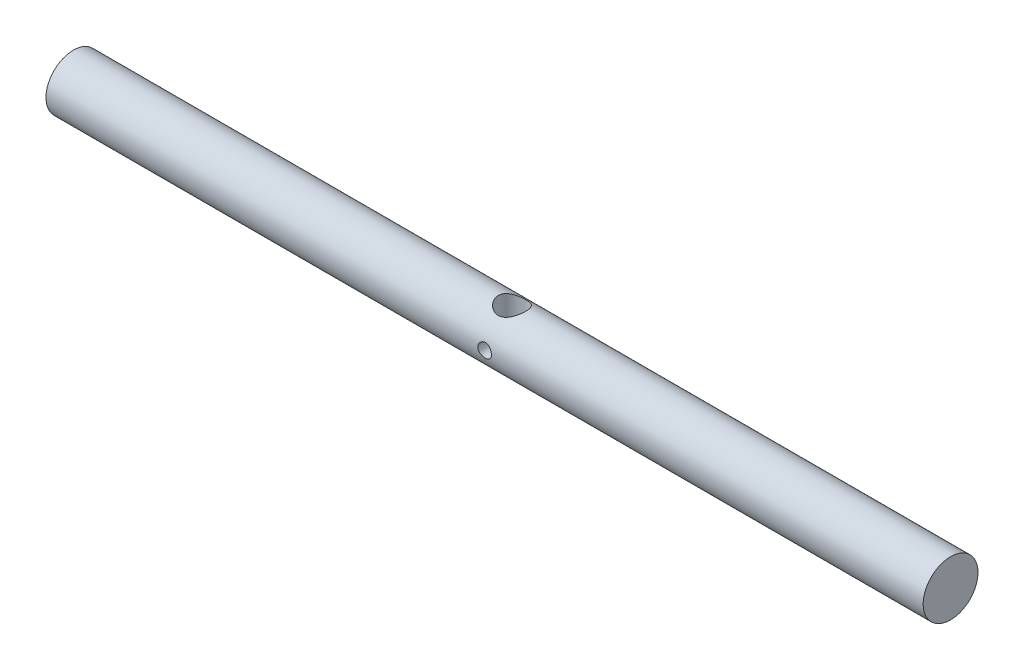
ISO-10303-21;
HEADER;
FILE_DESCRIPTION(('STEP AP214'),'2;1');
FILE_NAME('part.step','',(''),(''),'','','');
FILE_SCHEMA(('AUTOMOTIVE_DESIGN { 1 0 10303 214 1 1 1 1 }'));
ENDSEC;
DATA;
#1=APPLICATION_CONTEXT('core data for automotive mechanical design processes');
#2=APPLICATION_PROTOCOL_DEFINITION('international standard','automotive_design',2000,#1);
#3=PRODUCT_CONTEXT('',#1,'mechanical');
#4=PRODUCT('Part','Part','',(#3));
#5=PRODUCT_RELATED_PRODUCT_CATEGORY('part','',(#4));
#6=PRODUCT_DEFINITION_FORMATION('','',#4);
#7=PRODUCT_DEFINITION_CONTEXT('part definition',#1,'design');
#8=PRODUCT_DEFINITION('design','',#6,#7);
#9=PRODUCT_DEFINITION_SHAPE('','',#8);
#10=(LENGTH_UNIT() NAMED_UNIT(*) SI_UNIT(.MILLI.,.METRE.));
#11=(NAMED_UNIT(*) PLANE_ANGLE_UNIT() SI_UNIT($,.RADIAN.));
#12=(NAMED_UNIT(*) SI_UNIT($,.STERADIAN.) SOLID_ANGLE_UNIT());
#13=UNCERTAINTY_MEASURE_WITH_UNIT(LENGTH_MEASURE(1.E-05),#10,'distance_accuracy_value','');
#14=(GEOMETRIC_REPRESENTATION_CONTEXT(3) GLOBAL_UNCERTAINTY_ASSIGNED_CONTEXT((#13)) GLOBAL_UNIT_ASSIGNED_CONTEXT((#10,
#11,#12)) REPRESENTATION_CONTEXT('',''));
#15=CARTESIAN_POINT('',(0.,0.,0.));
#16=DIRECTION('',(0.,0.,1.));
#17=DIRECTION('',(1.,0.,0.));
#18=AXIS2_PLACEMENT_3D('',#15,#16,#17);
#19=CARTESIAN_POINT('',(101.6,0.,0.));
#20=DIRECTION('',(-1.,0.,0.));
#21=DIRECTION('',(0.,0.,1.));
#22=AXIS2_PLACEMENT_3D('',#19,#20,#21);
#23=CYLINDRICAL_SURFACE('',#22,6.35);
#24=CARTESIAN_POINT('',(1.5748,0.,6.35));
#25=CARTESIAN_POINT('',(1.5747975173,-0.0870314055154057,6.34999851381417));
#26=CARTESIAN_POINT('',(1.56756102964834,-0.174090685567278,6.34819290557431));
#27=CARTESIAN_POINT('',(1.53884872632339,-0.345715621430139,6.34116489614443));
#28=CARTESIAN_POINT('',(1.51736469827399,-0.430279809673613,6.33594052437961));
#29=CARTESIAN_POINT('',(1.46088788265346,-0.594411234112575,6.32265372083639));
#30=CARTESIAN_POINT('',(1.42591117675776,-0.673984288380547,6.31459466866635));
#31=CARTESIAN_POINT('',(1.34349807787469,-0.826133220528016,6.29649757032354));
#32=CARTESIAN_POINT('',(1.29606131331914,-0.898708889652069,6.28645946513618));
#33=CARTESIAN_POINT('',(1.18905780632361,-1.03627575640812,6.2652669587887));
#34=CARTESIAN_POINT('',(1.12928586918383,-1.10110473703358,6.25409555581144));
#35=CARTESIAN_POINT('',(0.999748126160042,-1.2199283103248,6.23200894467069));
#36=CARTESIAN_POINT('',(0.929981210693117,-1.27392169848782,6.22109376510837));
#37=CARTESIAN_POINT('',(0.781178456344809,-1.37030112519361,6.20058431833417));
#38=CARTESIAN_POINT('',(0.702022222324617,-1.41250629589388,6.1910116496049));
#39=CARTESIAN_POINT('',(0.537462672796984,-1.48294830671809,6.1745187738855));
#40=CARTESIAN_POINT('',(0.452060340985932,-1.51118734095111,6.16759815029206));
#41=CARTESIAN_POINT('',(0.279215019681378,-1.55234324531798,6.15736758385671));
#42=CARTESIAN_POINT('',(0.191845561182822,-1.56555149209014,6.15398908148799));
#43=CARTESIAN_POINT('',(0.0160705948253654,-1.57717837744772,6.15102002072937));
#44=CARTESIAN_POINT('',(-0.0723347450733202,-1.57559938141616,6.15142885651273));
#45=CARTESIAN_POINT('',(-0.24544343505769,-1.55792921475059,6.15592662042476));
#46=CARTESIAN_POINT('',(-0.330184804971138,-1.54218465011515,6.15992764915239));
#47=CARTESIAN_POINT('',(-0.495784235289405,-1.49718293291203,6.1710189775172));
#48=CARTESIAN_POINT('',(-0.576642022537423,-1.46792483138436,6.17810949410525));
#49=CARTESIAN_POINT('',(-0.73311147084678,-1.39642966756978,6.1946619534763));
#50=CARTESIAN_POINT('',(-0.808662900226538,-1.35406631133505,6.2041467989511));
#51=CARTESIAN_POINT('',(-0.951709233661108,-1.25765153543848,6.22440620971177));
#52=CARTESIAN_POINT('',(-1.01920274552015,-1.20359810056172,6.23518099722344));
#53=CARTESIAN_POINT('',(-1.1462042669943,-1.08353949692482,6.25717682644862));
#54=CARTESIAN_POINT('',(-1.20543526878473,-1.01724167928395,6.26840190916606));
#55=CARTESIAN_POINT('',(-1.3119906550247,-0.875520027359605,6.28976089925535));
#56=CARTESIAN_POINT('',(-1.35931468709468,-0.800095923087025,6.2998947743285));
#57=CARTESIAN_POINT('',(-1.44081220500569,-0.641871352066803,6.31797867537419));
#58=CARTESIAN_POINT('',(-1.47494128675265,-0.559047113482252,6.32592130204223));
#59=CARTESIAN_POINT('',(-1.52871518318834,-0.388596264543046,6.33867391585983));
#60=CARTESIAN_POINT('',(-1.54836272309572,-0.300970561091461,6.34348449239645));
#61=CARTESIAN_POINT('',(-1.5721941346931,-0.125773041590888,6.34934398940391));
#62=CARTESIAN_POINT('',(-1.57675531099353,-0.0382555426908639,6.35048467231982));
#63=CARTESIAN_POINT('',(-1.57131854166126,0.136292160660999,6.34913692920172));
#64=CARTESIAN_POINT('',(-1.56132188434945,0.223322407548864,6.34664882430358));
#65=CARTESIAN_POINT('',(-1.52736436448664,0.393118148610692,6.33838181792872));
#66=CARTESIAN_POINT('',(-1.50360880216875,0.475927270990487,6.33265132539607));
#67=CARTESIAN_POINT('',(-1.44304185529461,0.636381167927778,6.31854505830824));
#68=CARTESIAN_POINT('',(-1.40622916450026,0.714025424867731,6.31016901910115));
#69=CARTESIAN_POINT('',(-1.31985802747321,0.863450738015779,6.29148051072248));
#70=CARTESIAN_POINT('',(-1.27008755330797,0.935105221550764,6.28113668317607));
#71=CARTESIAN_POINT('',(-1.15948520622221,1.06917928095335,6.25971032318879));
#72=CARTESIAN_POINT('',(-1.09865145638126,1.13159728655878,6.24862766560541));
#73=CARTESIAN_POINT('',(-0.965898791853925,1.24697723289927,6.22664329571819));
#74=CARTESIAN_POINT('',(-0.893747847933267,1.29967470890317,6.21575239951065));
#75=CARTESIAN_POINT('',(-0.741403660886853,1.39221304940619,6.19568346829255));
#76=CARTESIAN_POINT('',(-0.661210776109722,1.43205448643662,6.18650535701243));
#77=CARTESIAN_POINT('',(-0.495491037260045,1.4974542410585,6.1710016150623));
#78=CARTESIAN_POINT('',(-0.409999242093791,1.52309719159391,6.16465912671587));
#79=CARTESIAN_POINT('',(-0.235737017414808,1.55959722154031,6.15552736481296));
#80=CARTESIAN_POINT('',(-0.146967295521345,1.57045747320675,6.15273732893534));
#81=CARTESIAN_POINT('',(0.0286415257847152,1.57692007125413,6.15108381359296));
#82=CARTESIAN_POINT('',(0.115464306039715,1.57294485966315,6.15211161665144));
#83=CARTESIAN_POINT('',(0.287160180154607,1.5508146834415,6.15772698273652));
#84=CARTESIAN_POINT('',(0.372033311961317,1.53265999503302,6.16231447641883));
#85=CARTESIAN_POINT('',(0.536969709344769,1.48291522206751,6.17447222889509));
#86=CARTESIAN_POINT('',(0.617057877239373,1.45140317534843,6.18202514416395));
#87=CARTESIAN_POINT('',(0.770867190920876,1.37590016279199,6.19926541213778));
#88=CARTESIAN_POINT('',(0.844587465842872,1.33190749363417,6.20895305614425));
#89=CARTESIAN_POINT('',(0.985612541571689,1.2313624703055,6.22968225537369));
#90=CARTESIAN_POINT('',(1.05270382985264,1.17451644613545,6.24075220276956));
#91=CARTESIAN_POINT('',(1.17653248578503,1.05045222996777,6.26282786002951));
#92=CARTESIAN_POINT('',(1.23326739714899,0.983231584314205,6.27383355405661));
#93=CARTESIAN_POINT('',(1.33575329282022,0.838886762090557,6.294773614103));
#94=CARTESIAN_POINT('',(1.38129152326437,0.761608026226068,6.30468550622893));
#95=CARTESIAN_POINT('',(1.45865788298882,0.600253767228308,6.32208496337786));
#96=CARTESIAN_POINT('',(1.49049595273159,0.516183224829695,6.32957428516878));
#97=CARTESIAN_POINT('',(1.53476694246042,0.360204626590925,6.34016177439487));
#98=CARTESIAN_POINT('',(1.54974715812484,0.289047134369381,6.34382594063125));
#99=CARTESIAN_POINT('',(1.56976436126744,0.145266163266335,6.34874558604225));
#100=CARTESIAN_POINT('',(1.57480207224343,0.0726427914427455,6.35000124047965));
#101=CARTESIAN_POINT('',(1.5748,0.,6.35));
#102=B_SPLINE_CURVE_WITH_KNOTS('',3,(#24,#25,#26,#27,#28,#29,#30,#31,#32,#33,#34,#35,#36,#37,
#38,#39,#40,#41,#42,#43,#44,#45,#46,#47,#48,#49,#50,#51,#52,#53,#54,#55,#56,#57,#58,#59,#60,#61,
#62,#63,#64,#65,#66,#67,#68,#69,#70,#71,#72,#73,#74,#75,#76,#77,#78,#79,#80,#81,#82,#83,#84,#85,
#86,#87,#88,#89,#90,#91,#92,#93,#94,#95,#96,#97,#98,#99,#100,#101),.UNSPECIFIED.,.T.,.F.,(4,2,2,
2,2,2,2,2,2,2,2,2,2,2,2,2,2,2,2,2,2,2,2,2,2,2,2,2,2,2,2,2,2,2,2,2,2,2,4),(0.,0.260828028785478,
0.521806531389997,0.78247493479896,1.04315111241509,1.30857515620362,1.5740286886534,
1.84335565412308,2.11264029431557,2.3766107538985,2.6405389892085,2.8981799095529,
3.15583892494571,3.416062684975,3.67633133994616,3.94389855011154,4.21147367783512,
4.47994157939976,4.74835894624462,5.01001039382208,5.27163868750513,5.52946020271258,
5.78730751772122,6.04967281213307,6.31208265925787,6.58082333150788,6.84955203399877,
7.11666119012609,7.38371301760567,7.64321929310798,7.90272051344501,8.16072610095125,
8.41876691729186,8.6834379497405,8.94817167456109,9.21760267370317,9.48683785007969,
9.70455988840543,9.92226608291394),.UNSPECIFIED.);
#103=CARTESIAN_POINT('',(1.5748,0.,6.35));
#104=VERTEX_POINT('',#103);
#105=EDGE_CURVE('E87',#104,#104,#102,.T.);
#106=ORIENTED_EDGE('',*,*,#105,.T.);
#107=EDGE_LOOP('',(#106));
#108=FACE_BOUND('',#107,.T.);
#109=CARTESIAN_POINT('',(1.5748,0.,-6.35));
#110=CARTESIAN_POINT('',(1.5747975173,0.0870314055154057,-6.34999851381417));
#111=CARTESIAN_POINT('',(1.56756102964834,0.174090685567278,-6.34819290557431));
#112=CARTESIAN_POINT('',(1.53884872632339,0.345715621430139,-6.34116489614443));
#113=CARTESIAN_POINT('',(1.51736469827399,0.430279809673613,-6.33594052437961));
#114=CARTESIAN_POINT('',(1.46088788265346,0.594411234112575,-6.32265372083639));
#115=CARTESIAN_POINT('',(1.42591117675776,0.673984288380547,-6.31459466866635));
#116=CARTESIAN_POINT('',(1.34349807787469,0.826133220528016,-6.29649757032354));
#117=CARTESIAN_POINT('',(1.29606131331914,0.898708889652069,-6.28645946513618));
#118=CARTESIAN_POINT('',(1.18905780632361,1.03627575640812,-6.2652669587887));
#119=CARTESIAN_POINT('',(1.12928586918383,1.10110473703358,-6.25409555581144));
#120=CARTESIAN_POINT('',(0.999748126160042,1.2199283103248,-6.23200894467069));
#121=CARTESIAN_POINT('',(0.929981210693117,1.27392169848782,-6.22109376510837));
#122=CARTESIAN_POINT('',(0.781178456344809,1.37030112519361,-6.20058431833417));
#123=CARTESIAN_POINT('',(0.702022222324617,1.41250629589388,-6.1910116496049));
#124=CARTESIAN_POINT('',(0.537462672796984,1.48294830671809,-6.1745187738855));
#125=CARTESIAN_POINT('',(0.452060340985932,1.51118734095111,-6.16759815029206));
#126=CARTESIAN_POINT('',(0.279215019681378,1.55234324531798,-6.15736758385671));
#127=CARTESIAN_POINT('',(0.191845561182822,1.56555149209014,-6.15398908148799));
#128=CARTESIAN_POINT('',(0.0160705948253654,1.57717837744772,-6.15102002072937));
#129=CARTESIAN_POINT('',(-0.0723347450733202,1.57559938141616,-6.15142885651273));
#130=CARTESIAN_POINT('',(-0.24544343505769,1.55792921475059,-6.15592662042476));
#131=CARTESIAN_POINT('',(-0.330184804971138,1.54218465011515,-6.15992764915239));
#132=CARTESIAN_POINT('',(-0.495784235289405,1.49718293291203,-6.1710189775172));
#133=CARTESIAN_POINT('',(-0.576642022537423,1.46792483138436,-6.17810949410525));
#134=CARTESIAN_POINT('',(-0.73311147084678,1.39642966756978,-6.1946619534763));
#135=CARTESIAN_POINT('',(-0.808662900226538,1.35406631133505,-6.2041467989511));
#136=CARTESIAN_POINT('',(-0.951709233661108,1.25765153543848,-6.22440620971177));
#137=CARTESIAN_POINT('',(-1.01920274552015,1.20359810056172,-6.23518099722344));
#138=CARTESIAN_POINT('',(-1.1462042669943,1.08353949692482,-6.25717682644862));
#139=CARTESIAN_POINT('',(-1.20543526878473,1.01724167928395,-6.26840190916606));
#140=CARTESIAN_POINT('',(-1.3119906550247,0.875520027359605,-6.28976089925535));
#141=CARTESIAN_POINT('',(-1.35931468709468,0.800095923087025,-6.2998947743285));
#142=CARTESIAN_POINT('',(-1.44081220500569,0.641871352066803,-6.31797867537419));
#143=CARTESIAN_POINT('',(-1.47494128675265,0.559047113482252,-6.32592130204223));
#144=CARTESIAN_POINT('',(-1.52871518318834,0.388596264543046,-6.33867391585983));
#145=CARTESIAN_POINT('',(-1.54836272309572,0.300970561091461,-6.34348449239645));
#146=CARTESIAN_POINT('',(-1.5721941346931,0.125773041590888,-6.34934398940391));
#147=CARTESIAN_POINT('',(-1.57675531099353,0.0382555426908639,-6.35048467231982));
#148=CARTESIAN_POINT('',(-1.57131854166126,-0.136292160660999,-6.34913692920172));
#149=CARTESIAN_POINT('',(-1.56132188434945,-0.223322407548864,-6.34664882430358));
#150=CARTESIAN_POINT('',(-1.52736436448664,-0.393118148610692,-6.33838181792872));
#151=CARTESIAN_POINT('',(-1.50360880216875,-0.475927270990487,-6.33265132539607));
#152=CARTESIAN_POINT('',(-1.44304185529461,-0.636381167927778,-6.31854505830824));
#153=CARTESIAN_POINT('',(-1.40622916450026,-0.714025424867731,-6.31016901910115));
#154=CARTESIAN_POINT('',(-1.31985802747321,-0.863450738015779,-6.29148051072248));
#155=CARTESIAN_POINT('',(-1.27008755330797,-0.935105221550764,-6.28113668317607));
#156=CARTESIAN_POINT('',(-1.15948520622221,-1.06917928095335,-6.25971032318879));
#157=CARTESIAN_POINT('',(-1.09865145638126,-1.13159728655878,-6.24862766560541));
#158=CARTESIAN_POINT('',(-0.965898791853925,-1.24697723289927,-6.22664329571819));
#159=CARTESIAN_POINT('',(-0.893747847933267,-1.29967470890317,-6.21575239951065));
#160=CARTESIAN_POINT('',(-0.741403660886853,-1.39221304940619,-6.19568346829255));
#161=CARTESIAN_POINT('',(-0.661210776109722,-1.43205448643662,-6.18650535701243));
#162=CARTESIAN_POINT('',(-0.495491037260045,-1.4974542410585,-6.1710016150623));
#163=CARTESIAN_POINT('',(-0.409999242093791,-1.52309719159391,-6.16465912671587));
#164=CARTESIAN_POINT('',(-0.235737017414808,-1.55959722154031,-6.15552736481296));
#165=CARTESIAN_POINT('',(-0.146967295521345,-1.57045747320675,-6.15273732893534));
#166=CARTESIAN_POINT('',(0.0286415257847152,-1.57692007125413,-6.15108381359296));
#167=CARTESIAN_POINT('',(0.115464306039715,-1.57294485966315,-6.15211161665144));
#168=CARTESIAN_POINT('',(0.287160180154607,-1.5508146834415,-6.15772698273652));
#169=CARTESIAN_POINT('',(0.372033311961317,-1.53265999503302,-6.16231447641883));
#170=CARTESIAN_POINT('',(0.536969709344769,-1.48291522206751,-6.17447222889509));
#171=CARTESIAN_POINT('',(0.617057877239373,-1.45140317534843,-6.18202514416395));
#172=CARTESIAN_POINT('',(0.770867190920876,-1.37590016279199,-6.19926541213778));
#173=CARTESIAN_POINT('',(0.844587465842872,-1.33190749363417,-6.20895305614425));
#174=CARTESIAN_POINT('',(0.985612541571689,-1.2313624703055,-6.22968225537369));
#175=CARTESIAN_POINT('',(1.05270382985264,-1.17451644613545,-6.24075220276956));
#176=CARTESIAN_POINT('',(1.17653248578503,-1.05045222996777,-6.26282786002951));
#177=CARTESIAN_POINT('',(1.23326739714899,-0.983231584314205,-6.27383355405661));
#178=CARTESIAN_POINT('',(1.33575329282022,-0.838886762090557,-6.294773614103));
#179=CARTESIAN_POINT('',(1.38129152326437,-0.761608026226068,-6.30468550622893));
#180=CARTESIAN_POINT('',(1.45865788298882,-0.600253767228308,-6.32208496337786));
#181=CARTESIAN_POINT('',(1.49049595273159,-0.516183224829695,-6.32957428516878));
#182=CARTESIAN_POINT('',(1.53476694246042,-0.360204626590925,-6.34016177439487));
#183=CARTESIAN_POINT('',(1.54974715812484,-0.289047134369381,-6.34382594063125));
#184=CARTESIAN_POINT('',(1.56976436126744,-0.145266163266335,-6.34874558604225));
#185=CARTESIAN_POINT('',(1.57480207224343,-0.0726427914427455,-6.35000124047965));
#186=CARTESIAN_POINT('',(1.5748,0.,-6.35));
#187=B_SPLINE_CURVE_WITH_KNOTS('',3,(#109,#110,#111,#112,#113,#114,#115,#116,#117,#118,#119,
#120,#121,#122,#123,#124,#125,#126,#127,#128,#129,#130,#131,#132,#133,#134,#135,#136,#137,#138,
#139,#140,#141,#142,#143,#144,#145,#146,#147,#148,#149,#150,#151,#152,#153,#154,#155,#156,#157,
#158,#159,#160,#161,#162,#163,#164,#165,#166,#167,#168,#169,#170,#171,#172,#173,#174,#175,#176,
#177,#178,#179,#180,#181,#182,#183,#184,#185,#186),.UNSPECIFIED.,.T.,.F.,(4,2,2,2,2,2,2,2,2,2,2,
2,2,2,2,2,2,2,2,2,2,2,2,2,2,2,2,2,2,2,2,2,2,2,2,2,2,2,4),(0.,0.260828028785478,
0.521806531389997,0.78247493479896,1.04315111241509,1.30857515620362,1.5740286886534,
1.84335565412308,2.11264029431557,2.3766107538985,2.6405389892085,2.8981799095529,
3.15583892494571,3.416062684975,3.67633133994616,3.94389855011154,4.21147367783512,
4.47994157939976,4.74835894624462,5.01001039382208,5.27163868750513,5.52946020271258,
5.78730751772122,6.04967281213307,6.31208265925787,6.58082333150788,6.84955203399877,
7.11666119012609,7.38371301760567,7.64321929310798,7.90272051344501,8.16072610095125,
8.41876691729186,8.6834379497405,8.94817167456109,9.21760267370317,9.48683785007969,
9.70455988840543,9.92226608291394),.UNSPECIFIED.);
#188=CARTESIAN_POINT('',(1.5748,0.,-6.35));
#189=VERTEX_POINT('',#188);
#190=EDGE_CURVE('E94',#189,#189,#187,.T.);
#191=ORIENTED_EDGE('',*,*,#190,.T.);
#192=EDGE_LOOP('',(#191));
#193=FACE_BOUND('',#192,.T.);
#194=CARTESIAN_POINT('',(-3.175,-6.35000000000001,0.));
#195=CARTESIAN_POINT('',(-3.17499911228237,-6.34999931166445,0.0834969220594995));
#196=CARTESIAN_POINT('',(-3.17170012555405,-6.34834758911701,0.167002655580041));
#197=CARTESIAN_POINT('',(-3.15855412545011,-6.34179105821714,0.33337833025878));
#198=CARTESIAN_POINT('',(-3.14870426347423,-6.33688483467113,0.41624797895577));
#199=CARTESIAN_POINT('',(-3.10942793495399,-6.31742426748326,0.663182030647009));
#200=CARTESIAN_POINT('',(-3.0702749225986,-6.29812827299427,0.825450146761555));
#201=CARTESIAN_POINT('',(-2.96800928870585,-6.24891823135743,1.13965128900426));
#202=CARTESIAN_POINT('',(-2.90498978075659,-6.21904547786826,1.29162180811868));
#203=CARTESIAN_POINT('',(-2.7572639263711,-6.15142812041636,1.58264035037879));
#204=CARTESIAN_POINT('',(-2.67255928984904,-6.11368413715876,1.72168939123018));
#205=CARTESIAN_POINT('',(-2.47803037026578,-6.03111096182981,1.99234108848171));
#206=CARTESIAN_POINT('',(-2.36699642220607,-5.98599127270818,2.12298433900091));
#207=CARTESIAN_POINT('',(-2.12560331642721,-5.89470535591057,2.36467069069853));
#208=CARTESIAN_POINT('',(-1.99522957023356,-5.84853836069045,2.47569885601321));
#209=CARTESIAN_POINT('',(-1.70657905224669,-5.75623634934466,2.68368848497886));
#210=CARTESIAN_POINT('',(-1.54692246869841,-5.71038146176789,2.77889135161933));
#211=CARTESIAN_POINT('',(-1.29545201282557,-5.64919759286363,2.90019349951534));
#212=CARTESIAN_POINT('',(-1.20959993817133,-5.63006420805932,2.93705266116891));
#213=CARTESIAN_POINT('',(-1.03441438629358,-5.59504604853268,3.00322508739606));
#214=CARTESIAN_POINT('',(-0.945083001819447,-5.5791593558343,3.03254280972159));
#215=CARTESIAN_POINT('',(-0.768989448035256,-5.5521261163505,3.08174263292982));
#216=CARTESIAN_POINT('',(-0.682389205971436,-5.54075429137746,3.10208128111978));
#217=CARTESIAN_POINT('',(-0.507412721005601,-5.52193654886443,3.13545600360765));
#218=CARTESIAN_POINT('',(-0.419037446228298,-5.51448854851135,3.14849595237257));
#219=CARTESIAN_POINT('',(-0.241293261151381,-5.50383875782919,3.1670771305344));
#220=CARTESIAN_POINT('',(-0.151924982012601,-5.50063441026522,3.1726228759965));
#221=CARTESIAN_POINT('',(0.0269807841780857,-5.49859788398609,3.17614778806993));
#222=CARTESIAN_POINT('',(0.116518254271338,-5.49976528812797,3.17412767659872));
#223=CARTESIAN_POINT('',(0.362747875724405,-5.5089919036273,3.1581193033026));
#224=CARTESIAN_POINT('',(0.518841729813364,-5.52160857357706,3.13621253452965));
#225=CARTESIAN_POINT('',(0.824646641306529,-5.55866493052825,3.07003746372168));
#226=CARTESIAN_POINT('',(0.974355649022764,-5.58310838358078,3.02576203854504));
#227=CARTESIAN_POINT('',(1.26754429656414,-5.64157885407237,2.91531509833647));
#228=CARTESIAN_POINT('',(1.41079760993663,-5.67581583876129,2.84865758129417));
#229=CARTESIAN_POINT('',(1.68476608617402,-5.75003268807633,2.69570761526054));
#230=CARTESIAN_POINT('',(1.81547557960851,-5.79001512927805,2.60940634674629));
#231=CARTESIAN_POINT('',(2.07810427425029,-5.87734289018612,2.40685964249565));
#232=CARTESIAN_POINT('',(2.2080753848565,-5.92497898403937,2.28820488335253));
#233=CARTESIAN_POINT('',(2.44708514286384,-6.01813700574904,2.03058898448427));
#234=CARTESIAN_POINT('',(2.5561137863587,-6.06365791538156,1.89161819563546));
#235=CARTESIAN_POINT('',(2.75490191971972,-6.15003810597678,1.58913989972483));
#236=CARTESIAN_POINT('',(2.84353148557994,-6.19058274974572,1.42479265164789));
#237=CARTESIAN_POINT('',(2.99115808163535,-6.25976272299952,1.08098023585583));
#238=CARTESIAN_POINT('',(3.05017864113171,-6.28840750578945,0.901527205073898));
#239=CARTESIAN_POINT('',(3.13205940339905,-6.32854759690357,0.548533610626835));
#240=CARTESIAN_POINT('',(3.15750967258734,-6.34126679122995,0.375734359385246));
#241=CARTESIAN_POINT('',(3.17965052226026,-6.35231817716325,0.0278752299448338));
#242=CARTESIAN_POINT('',(3.17635472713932,-6.35065718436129,-0.147183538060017));
#243=CARTESIAN_POINT('',(3.14259376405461,-6.33384535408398,-0.480164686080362));
#244=CARTESIAN_POINT('',(3.11425420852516,-6.31975005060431,-0.63836362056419));
#245=CARTESIAN_POINT('',(3.03454412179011,-6.28085393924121,-0.947441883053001));
#246=CARTESIAN_POINT('',(2.98317105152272,-6.25605195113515,-1.09832040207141));
#247=CARTESIAN_POINT('',(2.8575048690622,-6.19709998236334,-1.39347133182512));
#248=CARTESIAN_POINT('',(2.78259841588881,-6.16270299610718,-1.53743151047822));
#249=CARTESIAN_POINT('',(2.61268357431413,-6.08787118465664,-1.8112148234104));
#250=CARTESIAN_POINT('',(2.5176666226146,-6.04743378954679,-1.94103189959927));
#251=CARTESIAN_POINT('',(2.29946064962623,-5.95973602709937,-2.19636241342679));
#252=CARTESIAN_POINT('',(2.17442139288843,-5.91219559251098,-2.3202013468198));
#253=CARTESIAN_POINT('',(1.90523764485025,-5.81858093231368,-2.54589381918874));
#254=CARTESIAN_POINT('',(1.76108004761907,-5.77250773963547,-2.6477321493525));
#255=CARTESIAN_POINT('',(1.44893139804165,-5.68487535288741,-2.83117262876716));
#256=CARTESIAN_POINT('',(1.28012423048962,-5.6436428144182,-2.91155594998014));
#257=CARTESIAN_POINT('',(0.928655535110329,-5.57447679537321,-3.04191297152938));
#258=CARTESIAN_POINT('',(0.746012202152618,-5.54652618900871,-3.0919258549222));
#259=CARTESIAN_POINT('',(0.390810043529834,-5.51057765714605,-3.15551086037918));
#260=CARTESIAN_POINT('',(0.218966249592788,-5.50092192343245,-3.17212027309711));
#261=CARTESIAN_POINT('',(-0.125244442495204,-5.49800001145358,-3.17718805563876));
#262=CARTESIAN_POINT('',(-0.297611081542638,-5.5047267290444,-3.16565862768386));
#263=CARTESIAN_POINT('',(-0.620660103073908,-5.53205211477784,-3.11761548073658));
#264=CARTESIAN_POINT('',(-0.771843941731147,-5.55126823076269,-3.08358651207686));
#265=CARTESIAN_POINT('',(-1.06619083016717,-5.59977978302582,-2.99458164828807));
#266=CARTESIAN_POINT('',(-1.2093512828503,-5.62907846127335,-2.93959901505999));
#267=CARTESIAN_POINT('',(-1.49423369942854,-5.69685576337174,-2.8061154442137));
#268=CARTESIAN_POINT('',(-1.63521280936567,-5.73581889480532,-2.72628260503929));
#269=CARTESIAN_POINT('',(-1.9026974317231,-5.81772207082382,-2.54682759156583));
#270=CARTESIAN_POINT('',(-2.02919535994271,-5.86066417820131,-2.44719512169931));
#271=CARTESIAN_POINT('',(-2.28009752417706,-5.95192753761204,-2.21680287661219));
#272=CARTESIAN_POINT('',(-2.4023797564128,-6.00026839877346,-2.08373188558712));
#273=CARTESIAN_POINT('',(-2.62339787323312,-6.09212345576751,-1.79751265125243));
#274=CARTESIAN_POINT('',(-2.72212106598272,-6.13563504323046,-1.64435365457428));
#275=CARTESIAN_POINT('',(-2.85028026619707,-6.19391073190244,-1.40178715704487));
#276=CARTESIAN_POINT('',(-2.88980058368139,-6.21223173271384,-1.31842200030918));
#277=CARTESIAN_POINT('',(-2.9615994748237,-6.24595363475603,-1.1480770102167));
#278=CARTESIAN_POINT('',(-2.99388160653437,-6.26135597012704,-1.06109897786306));
#279=CARTESIAN_POINT('',(-3.050759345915,-6.28875097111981,-0.884361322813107));
#280=CARTESIAN_POINT('',(-3.07537171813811,-6.30075106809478,-0.79460824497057));
#281=CARTESIAN_POINT('',(-3.11666738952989,-6.32100983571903,-0.612925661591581));
#282=CARTESIAN_POINT('',(-3.13335553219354,-6.3292707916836,-0.52099752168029));
#283=CARTESIAN_POINT('',(-3.15561628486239,-6.34032503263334,-0.357531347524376));
#284=CARTESIAN_POINT('',(-3.16287882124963,-6.34394670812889,-0.286274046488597));
#285=CARTESIAN_POINT('',(-3.17257112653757,-6.34878452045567,-0.143346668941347));
#286=CARTESIAN_POINT('',(-3.17500076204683,-6.35000059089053,-0.0716765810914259));
#287=CARTESIAN_POINT('',(-3.175,-6.35000000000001,0.));
#288=B_SPLINE_CURVE_WITH_KNOTS('',3,(#194,#195,#196,#197,#198,#199,#200,#201,#202,#203,#204,
#205,#206,#207,#208,#209,#210,#211,#212,#213,#214,#215,#216,#217,#218,#219,#220,#221,#222,#223,
#224,#225,#226,#227,#228,#229,#230,#231,#232,#233,#234,#235,#236,#237,#238,#239,#240,#241,#242,
#243,#244,#245,#246,#247,#248,#249,#250,#251,#252,#253,#254,#255,#256,#257,#258,#259,#260,#261,
#262,#263,#264,#265,#266,#267,#268,#269,#270,#271,#272,#273,#274,#275,#276,#277,#278,#279,#280,
#281,#282,#283,#284,#285,#286,#287),.UNSPECIFIED.,.T.,.F.,(4,2,2,2,2,2,2,2,2,2,2,2,2,2,2,2,2,2,
2,2,2,2,2,2,2,2,2,2,2,2,2,2,2,2,2,2,2,2,2,2,2,2,2,2,2,2,4),(0.,0.250415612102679,
0.500940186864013,1.00234854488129,1.50182051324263,2.00125310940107,2.53090025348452,
3.06094897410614,3.63210298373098,3.91787290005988,4.20347350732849,4.47213270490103,
4.74064915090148,5.00900371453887,5.27733267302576,5.74927594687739,6.22136960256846,
6.70445970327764,7.18776712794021,7.73235646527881,8.27720530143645,8.84735553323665,
9.41705196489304,9.93956405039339,10.4618285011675,10.9436138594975,11.4254523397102,
11.9210677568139,12.4168946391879,12.9614122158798,13.5063050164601,14.0775857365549,
14.6481278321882,15.1639000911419,15.6794487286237,16.1458838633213,16.6124691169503,
17.1104020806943,17.6085946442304,18.1673210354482,18.7263477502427,19.0082017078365,
19.2899168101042,19.5710117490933,19.8519346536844,20.0668939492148,20.2818591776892),.UNSPECIFIED.);
#289=CARTESIAN_POINT('',(-3.175,-6.35000000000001,0.));
#290=VERTEX_POINT('',#289);
#291=EDGE_CURVE('E10',#290,#290,#288,.T.);
#292=ORIENTED_EDGE('',*,*,#291,.T.);
#293=EDGE_LOOP('',(#292));
#294=FACE_BOUND('',#293,.T.);
#295=CARTESIAN_POINT('',(0.,5.4992613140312,3.175));
#296=CARTESIAN_POINT('',(-0.082761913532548,5.49926232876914,3.17499905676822));
#297=CARTESIAN_POINT('',(-0.165533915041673,5.50113815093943,3.17175738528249));
#298=CARTESIAN_POINT('',(-0.330420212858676,5.50856077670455,3.15884523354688));
#299=CARTESIAN_POINT('',(-0.412534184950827,5.51410928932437,3.1491717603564));
#300=CARTESIAN_POINT('',(-0.657165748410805,5.53601678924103,3.11062065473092));
#301=CARTESIAN_POINT('',(-0.817828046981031,5.55763722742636,3.07221261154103));
#302=CARTESIAN_POINT('',(-1.12859781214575,5.61178865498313,2.97211747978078));
#303=CARTESIAN_POINT('',(-1.27875644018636,5.6442615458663,2.9105541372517));
#304=CARTESIAN_POINT('',(-1.56661142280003,5.71635543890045,2.76627435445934));
#305=CARTESIAN_POINT('',(-1.70430710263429,5.75597682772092,2.68355676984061));
#306=CARTESIAN_POINT('',(-1.97582382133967,5.84190034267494,2.49131627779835));
#307=CARTESIAN_POINT('',(-2.10838859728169,5.88848395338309,2.38014521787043));
#308=CARTESIAN_POINT('',(-2.35397079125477,5.98081052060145,2.13758083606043));
#309=CARTESIAN_POINT('',(-2.466978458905,6.02655304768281,2.00617748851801));
#310=CARTESIAN_POINT('',(-2.67769095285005,6.11573187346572,1.71605436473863));
#311=CARTESIAN_POINT('',(-2.77385077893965,6.15880487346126,1.55609032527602));
#312=CARTESIAN_POINT('',(-2.93732214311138,6.2341365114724,1.21969855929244));
#313=CARTESIAN_POINT('',(-3.00465188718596,6.26640197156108,1.04328130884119));
#314=CARTESIAN_POINT('',(-3.10357731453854,6.31445464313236,0.692292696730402));
#315=CARTESIAN_POINT('',(-3.13737474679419,6.33125099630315,0.518483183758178));
#316=CARTESIAN_POINT('',(-3.17552742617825,6.35024078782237,0.166911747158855));
#317=CARTESIAN_POINT('',(-3.17990048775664,6.35244306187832,-0.0108477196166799));
#318=CARTESIAN_POINT('',(-3.15992929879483,6.34247467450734,-0.348718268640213));
#319=CARTESIAN_POINT('',(-3.13804925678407,6.33153724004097,-0.509019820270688));
#320=CARTESIAN_POINT('',(-3.07060336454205,6.29838229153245,-0.823321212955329));
#321=CARTESIAN_POINT('',(-3.02503574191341,6.27616393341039,-0.977320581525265));
#322=CARTESIAN_POINT('',(-2.9112126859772,6.2220977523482,-1.27733236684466));
#323=CARTESIAN_POINT('',(-2.84265207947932,6.19012095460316,-1.42320480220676));
#324=CARTESIAN_POINT('',(-2.68521427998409,6.11942032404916,-1.70172616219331));
#325=CARTESIAN_POINT('',(-2.59632981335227,6.08069407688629,-1.83437032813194));
#326=CARTESIAN_POINT('',(-2.39110469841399,5.99580926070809,-2.09605211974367));
#327=CARTESIAN_POINT('',(-2.27296290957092,5.94929416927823,-2.22356359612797));
#328=CARTESIAN_POINT('',(-2.01743760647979,5.85642633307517,-2.45777846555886));
#329=CARTESIAN_POINT('',(-1.88003942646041,5.81007373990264,-2.56446584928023));
#330=CARTESIAN_POINT('',(-1.57905223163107,5.71957289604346,-2.76069102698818));
#331=CARTESIAN_POINT('',(-1.41435408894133,5.67575155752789,-2.84870951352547));
#332=CARTESIAN_POINT('',(-1.15616243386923,5.61885247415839,-2.95849503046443));
#333=CARTESIAN_POINT('',(-1.06822207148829,5.60135560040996,-2.99138760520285));
#334=CARTESIAN_POINT('',(-0.889202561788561,5.56999217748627,-3.04938956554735));
#335=CARTESIAN_POINT('',(-0.798125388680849,5.5561233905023,-3.07450375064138));
#336=CARTESIAN_POINT('',(-0.620848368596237,5.53355357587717,-3.11492823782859));
#337=CARTESIAN_POINT('',(-0.534829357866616,5.52453156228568,-3.13085491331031));
#338=CARTESIAN_POINT('',(-0.361489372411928,5.51045313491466,-3.15556797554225));
#339=CARTESIAN_POINT('',(-0.274169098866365,5.50539465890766,-3.16435807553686));
#340=CARTESIAN_POINT('',(-0.0989848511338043,5.49945626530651,-3.17466835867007));
#341=CARTESIAN_POINT('',(-0.011121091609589,5.49857479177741,-3.17619124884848));
#342=CARTESIAN_POINT('',(0.16434483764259,5.50101508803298,-3.17195985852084));
#343=CARTESIAN_POINT('',(0.251947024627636,5.50433657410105,-3.16620606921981));
#344=CARTESIAN_POINT('',(0.494092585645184,5.51925588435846,-3.14018226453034));
#345=CARTESIAN_POINT('',(0.64760560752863,5.53528611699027,-3.11209439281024));
#346=CARTESIAN_POINT('',(0.947346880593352,5.57828096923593,-3.03433762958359));
#347=CARTESIAN_POINT('',(1.09357275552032,5.6052491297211,-2.98466174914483));
#348=CARTESIAN_POINT('',(1.38242262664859,5.66852625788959,-2.86273054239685));
#349=CARTESIAN_POINT('',(1.52456613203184,5.7052099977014,-2.78953600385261));
#350=CARTESIAN_POINT('',(1.79536718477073,5.7834564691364,-2.62346157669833));
#351=CARTESIAN_POINT('',(1.92401775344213,5.82502170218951,-2.53057157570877));
#352=CARTESIAN_POINT('',(2.18115687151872,5.91464405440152,-2.31405795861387));
#353=CARTESIAN_POINT('',(2.30758076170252,5.9628590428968,-2.18803622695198));
#354=CARTESIAN_POINT('',(2.53813404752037,6.0558119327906,-1.91580928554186));
#355=CARTESIAN_POINT('',(2.64225591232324,6.10054865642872,-1.76959728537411));
#356=CARTESIAN_POINT('',(2.82757152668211,6.18303824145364,-1.45584977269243));
#357=CARTESIAN_POINT('',(2.90808763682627,6.22057562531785,-1.28785333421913));
#358=CARTESIAN_POINT('',(3.03891285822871,6.28279651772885,-0.938283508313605));
#359=CARTESIAN_POINT('',(3.08924849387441,6.30749131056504,-0.75672220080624));
#360=CARTESIAN_POINT('',(3.15394519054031,6.33944338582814,-0.403160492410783));
#361=CARTESIAN_POINT('',(3.17118326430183,6.34809271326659,-0.23181133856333));
#362=CARTESIAN_POINT('',(3.17767735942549,6.35133763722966,0.111525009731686));
#363=CARTESIAN_POINT('',(3.16694317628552,6.34593815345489,0.283511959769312));
#364=CARTESIAN_POINT('',(3.11970294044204,6.32250351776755,0.611308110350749));
#365=CARTESIAN_POINT('',(3.08494172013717,6.30532443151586,0.767436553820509));
#366=CARTESIAN_POINT('',(2.99298666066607,6.26084894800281,1.07139095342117));
#367=CARTESIAN_POINT('',(2.93578960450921,6.23355109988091,1.21921571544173));
#368=CARTESIAN_POINT('',(2.79804206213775,6.16984840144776,1.50946910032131));
#369=CARTESIAN_POINT('',(2.7165973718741,6.13310397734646,1.65139651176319));
#370=CARTESIAN_POINT('',(2.53378184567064,6.05434784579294,1.92016030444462));
#371=CARTESIAN_POINT('',(2.43240185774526,6.0123337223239,2.04698971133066));
#372=CARTESIAN_POINT('',(2.20092616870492,5.92228494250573,2.29524860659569));
#373=CARTESIAN_POINT('',(2.06897676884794,5.87406724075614,2.41488454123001));
#374=CARTESIAN_POINT('',(1.7860662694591,5.78049654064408,2.63101905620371));
#375=CARTESIAN_POINT('',(1.63508852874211,5.73514610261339,2.7274971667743));
#376=CARTESIAN_POINT('',(1.39432051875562,5.67271720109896,2.85396050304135));
#377=CARTESIAN_POINT('',(1.31024227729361,5.65257123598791,2.89354057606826));
#378=CARTESIAN_POINT('',(1.13839277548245,5.61522862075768,2.96535747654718));
#379=CARTESIAN_POINT('',(1.0506234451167,5.59803045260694,2.99759808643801));
#380=CARTESIAN_POINT('',(0.872230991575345,5.5673118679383,3.0542719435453));
#381=CARTESIAN_POINT('',(0.781615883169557,5.55378200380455,3.07872527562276));
#382=CARTESIAN_POINT('',(0.598111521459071,5.53094387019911,3.11956903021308));
#383=CARTESIAN_POINT('',(0.505223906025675,5.52163264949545,3.13596509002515));
#384=CARTESIAN_POINT('',(0.34353625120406,5.50956192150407,3.15710761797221));
#385=CARTESIAN_POINT('',(0.275066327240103,5.50570868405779,3.16381073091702));
#386=CARTESIAN_POINT('',(0.137733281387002,5.50055787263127,3.17275746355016));
#387=CARTESIAN_POINT('',(0.0688701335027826,5.49926046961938,3.17500078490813));
#388=CARTESIAN_POINT('',(0.,5.4992613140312,3.175));
#389=B_SPLINE_CURVE_WITH_KNOTS('',3,(#295,#296,#297,#298,#299,#300,#301,#302,#303,#304,#305,
#306,#307,#308,#309,#310,#311,#312,#313,#314,#315,#316,#317,#318,#319,#320,#321,#322,#323,#324,
#325,#326,#327,#328,#329,#330,#331,#332,#333,#334,#335,#336,#337,#338,#339,#340,#341,#342,#343,
#344,#345,#346,#347,#348,#349,#350,#351,#352,#353,#354,#355,#356,#357,#358,#359,#360,#361,#362,
#363,#364,#365,#366,#367,#368,#369,#370,#371,#372,#373,#374,#375,#376,#377,#378,#379,#380,#381,
#382,#383,#384,#385,#386,#387,#388),.UNSPECIFIED.,.T.,.F.,(4,2,2,2,2,2,2,2,2,2,2,2,2,2,2,2,2,2,
2,2,2,2,2,2,2,2,2,2,2,2,2,2,2,2,2,2,2,2,2,2,2,2,2,2,2,2,4),(0.,0.248210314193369,
0.496536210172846,0.993616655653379,1.48807751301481,1.98256512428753,2.51783706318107,
3.05337510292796,3.62501229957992,4.19628797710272,4.72691486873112,5.25722047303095,
5.74141031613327,6.22563639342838,6.71656194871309,7.20766347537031,7.74518754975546,
8.2831232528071,8.85521994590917,9.14138502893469,9.42737318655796,9.69083660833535,
9.95416285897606,10.2173910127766,10.4806013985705,10.9489167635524,11.4173838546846,
11.9075481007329,12.3979646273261,12.9502005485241,13.5026226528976,14.0696241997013,
14.6361266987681,15.1506510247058,15.6649951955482,16.1454469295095,16.625967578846,
17.1270402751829,17.6283435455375,18.1795366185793,18.7312151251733,19.0161455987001,
19.3009288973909,19.5849716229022,19.8688153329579,20.075349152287,20.2818967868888),.UNSPECIFIED.);
#390=CARTESIAN_POINT('',(0.,5.4992613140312,3.175));
#391=VERTEX_POINT('',#390);
#392=EDGE_CURVE('E46',#391,#391,#389,.T.);
#393=ORIENTED_EDGE('',*,*,#392,.T.);
#394=EDGE_LOOP('',(#393));
#395=FACE_BOUND('',#394,.T.);
#396=CARTESIAN_POINT('',(101.6,0.,0.));
#397=DIRECTION('',(1.,0.,0.));
#398=DIRECTION('',(0.,0.,-1.));
#399=AXIS2_PLACEMENT_3D('',#396,#397,#398);
#400=CIRCLE('',#399,6.35);
#401=CARTESIAN_POINT('',(101.6,0.,-6.35));
#402=VERTEX_POINT('',#401);
#403=EDGE_CURVE('E51',#402,#402,#400,.T.);
#404=ORIENTED_EDGE('',*,*,#403,.F.);
#405=EDGE_LOOP('',(#404));
#406=FACE_BOUND('',#405,.T.);
#407=CARTESIAN_POINT('',(-101.6,0.,0.));
#408=DIRECTION('',(1.,0.,0.));
#409=DIRECTION('',(0.,0.,-1.));
#410=AXIS2_PLACEMENT_3D('',#407,#408,#409);
#411=CIRCLE('',#410,6.35);
#412=CARTESIAN_POINT('',(-101.6,0.,-6.35));
#413=VERTEX_POINT('',#412);
#414=EDGE_CURVE('E85',#413,#413,#411,.T.);
#415=ORIENTED_EDGE('',*,*,#414,.T.);
#416=EDGE_LOOP('',(#415));
#417=FACE_BOUND('',#416,.T.);
#418=ADVANCED_FACE('F34',(#108,#193,#294,#395,#406,#417),#23,.T.);
#419=CARTESIAN_POINT('',(101.6,0.,0.));
#420=DIRECTION('',(1.,0.,0.));
#421=DIRECTION('',(0.,0.,-1.));
#422=AXIS2_PLACEMENT_3D('',#419,#420,#421);
#423=PLANE('',#422);
#424=ORIENTED_EDGE('',*,*,#403,.T.);
#425=EDGE_LOOP('',(#424));
#426=FACE_BOUND('',#425,.T.);
#427=ADVANCED_FACE('F74',(#426),#423,.T.);
#428=CARTESIAN_POINT('',(-101.6,0.,0.));
#429=DIRECTION('',(1.,0.,0.));
#430=DIRECTION('',(0.,0.,-1.));
#431=AXIS2_PLACEMENT_3D('',#428,#429,#430);
#432=PLANE('',#431);
#433=ORIENTED_EDGE('',*,*,#414,.F.);
#434=EDGE_LOOP('',(#433));
#435=FACE_BOUND('',#434,.T.);
#436=ADVANCED_FACE('F66',(#435),#432,.F.);
#437=CARTESIAN_POINT('',(0.,-6.35000000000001,0.));
#438=DIRECTION('',(0.,1.,0.));
#439=DIRECTION('',(0.,0.,1.));
#440=AXIS2_PLACEMENT_3D('',#437,#438,#439);
#441=CYLINDRICAL_SURFACE('',#440,3.175);
#442=CARTESIAN_POINT('',(0.,-1.57479999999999,3.175));
#443=CARTESIAN_POINT('',(0.0828695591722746,-1.57479485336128,3.1749955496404));
#444=CARTESIAN_POINT('',(0.165840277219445,-1.56822036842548,3.17172065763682));
#445=CARTESIAN_POINT('',(0.329334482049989,-1.54221082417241,3.15894297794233));
#446=CARTESIAN_POINT('',(0.409852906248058,-1.52275082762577,3.14942811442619));
#447=CARTESIAN_POINT('',(0.565826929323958,-1.47191595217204,3.12516740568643));
#448=CARTESIAN_POINT('',(0.641300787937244,-1.44058712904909,3.11044179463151));
#449=CARTESIAN_POINT('',(0.785811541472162,-1.3671398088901,3.07711429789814));
#450=CARTESIAN_POINT('',(0.854849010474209,-1.32502227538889,3.05851275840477));
#451=CARTESIAN_POINT('',(0.989172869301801,-1.22832584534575,3.01784305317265));
#452=CARTESIAN_POINT('',(1.0539879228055,-1.17315228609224,2.99563408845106));
#453=CARTESIAN_POINT('',(1.17387778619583,-1.0531887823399,2.95071894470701));
#454=CARTESIAN_POINT('',(1.22894530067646,-0.988391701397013,2.92801240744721));
#455=CARTESIAN_POINT('',(1.33197066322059,-0.845110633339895,2.88268691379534));
#456=CARTESIAN_POINT('',(1.37907010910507,-0.765960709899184,2.86020576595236));
#457=CARTESIAN_POINT('',(1.45908950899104,-0.599627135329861,2.82022995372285));
#458=CARTESIAN_POINT('',(1.492019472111,-0.512449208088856,2.80273177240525));
#459=CARTESIAN_POINT('',(1.54064307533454,-0.337826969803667,2.77628780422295));
#460=CARTESIAN_POINT('',(1.55724496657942,-0.250706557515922,2.76689545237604));
#461=CARTESIAN_POINT('',(1.57552566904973,-0.0744523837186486,2.75653175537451));
#462=CARTESIAN_POINT('',(1.57721880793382,0.0146793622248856,2.75555232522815));
#463=CARTESIAN_POINT('',(1.56630096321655,0.181197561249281,2.7617648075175));
#464=CARTESIAN_POINT('',(1.55534331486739,0.258736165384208,2.76801240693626));
#465=CARTESIAN_POINT('',(1.52229465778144,0.410684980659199,2.78632324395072));
#466=CARTESIAN_POINT('',(1.50020019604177,0.485094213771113,2.79838828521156));
#467=CARTESIAN_POINT('',(1.44509743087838,0.630793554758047,2.82724252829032));
#468=CARTESIAN_POINT('',(1.41184667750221,0.70197048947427,2.84413531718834));
#469=CARTESIAN_POINT('',(1.33556003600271,0.838073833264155,2.88074514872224));
#470=CARTESIAN_POINT('',(1.29251975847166,0.902997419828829,2.90046345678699));
#471=CARTESIAN_POINT('',(1.19162459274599,1.03326181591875,2.94347073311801));
#472=CARTESIAN_POINT('',(1.13259236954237,1.09764804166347,2.96689859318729));
#473=CARTESIAN_POINT('',(1.00446401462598,1.21600062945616,3.01269085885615));
#474=CARTESIAN_POINT('',(0.935363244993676,1.26996216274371,3.0350547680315));
#475=CARTESIAN_POINT('',(0.785112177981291,1.36821134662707,3.07743042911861));
#476=CARTESIAN_POINT('',(0.703559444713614,1.41195406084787,3.09729094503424));
#477=CARTESIAN_POINT('',(0.533017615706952,1.48474360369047,3.13114202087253));
#478=CARTESIAN_POINT('',(0.444034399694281,1.51380192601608,3.1451371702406));
#479=CARTESIAN_POINT('',(0.2689762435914,1.55404006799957,3.16471002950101));
#480=CARTESIAN_POINT('',(0.183260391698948,1.56648968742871,3.17088346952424));
#481=CARTESIAN_POINT('',(0.0107463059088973,1.57712949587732,3.17615217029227));
#482=CARTESIAN_POINT('',(-0.0760514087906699,1.57532628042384,3.17525070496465));
#483=CARTESIAN_POINT('',(-0.241254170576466,1.55825615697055,3.16681973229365));
#484=CARTESIAN_POINT('',(-0.319795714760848,1.54402291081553,3.15979916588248));
#485=CARTESIAN_POINT('',(-0.473221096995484,1.5041084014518,3.14048847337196));
#486=CARTESIAN_POINT('',(-0.548104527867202,1.47842586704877,3.12819776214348));
#487=CARTESIAN_POINT('',(-0.694591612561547,1.41565288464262,3.09901759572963));
#488=CARTESIAN_POINT('',(-0.76603778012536,1.3782539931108,3.08200542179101));
#489=CARTESIAN_POINT('',(-0.901879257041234,1.29345574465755,3.04502915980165));
#490=CARTESIAN_POINT('',(-0.966271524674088,1.24605209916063,3.02506380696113));
#491=CARTESIAN_POINT('',(-1.09279775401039,1.13728030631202,2.98182987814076));
#492=CARTESIAN_POINT('',(-1.15410687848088,1.07500365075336,2.95842874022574));
#493=CARTESIAN_POINT('',(-1.26576957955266,0.940977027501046,2.91240577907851));
#494=CARTESIAN_POINT('',(-1.31611587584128,0.869220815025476,2.88978448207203));
#495=CARTESIAN_POINT('',(-1.4066091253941,0.714055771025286,2.84687605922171));
#496=CARTESIAN_POINT('',(-1.44617521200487,0.630261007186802,2.82674571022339));
#497=CARTESIAN_POINT('',(-1.51022057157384,0.455880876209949,2.79306068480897));
#498=CARTESIAN_POINT('',(-1.53471897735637,0.365304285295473,2.77949767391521));
#499=CARTESIAN_POINT('',(-1.56569998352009,0.189188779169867,2.76215414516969));
#500=CARTESIAN_POINT('',(-1.57367926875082,0.103994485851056,2.75756330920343));
#501=CARTESIAN_POINT('',(-1.57569872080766,-0.0665986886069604,2.75641150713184));
#502=CARTESIAN_POINT('',(-1.56974461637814,-0.151997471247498,2.7598472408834));
#503=CARTESIAN_POINT('',(-1.54545979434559,-0.312266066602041,2.77350674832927));
#504=CARTESIAN_POINT('',(-1.52832312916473,-0.387379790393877,2.78307418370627));
#505=CARTESIAN_POINT('',(-1.48361899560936,-0.533589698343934,2.80715878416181));
#506=CARTESIAN_POINT('',(-1.45604821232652,-0.604684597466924,2.82167752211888));
#507=CARTESIAN_POINT('',(-1.3891790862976,-0.746125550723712,2.85522187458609));
#508=CARTESIAN_POINT('',(-1.34921679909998,-0.816099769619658,2.87448490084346));
#509=CARTESIAN_POINT('',(-1.2594409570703,-0.948803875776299,2.91493689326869));
#510=CARTESIAN_POINT('',(-1.20962232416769,-1.01153000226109,2.93612684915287));
#511=CARTESIAN_POINT('',(-1.09460032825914,-1.13570721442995,2.98106037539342));
#512=CARTESIAN_POINT('',(-1.02827216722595,-1.19612061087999,3.00480810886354));
#513=CARTESIAN_POINT('',(-0.885743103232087,-1.30518418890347,3.04986327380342));
#514=CARTESIAN_POINT('',(-0.809537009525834,-1.35382814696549,3.07116941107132));
#515=CARTESIAN_POINT('',(-0.648534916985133,-1.43794667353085,3.10916443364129));
#516=CARTESIAN_POINT('',(-0.563695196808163,-1.47334948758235,3.1258280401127));
#517=CARTESIAN_POINT('',(-0.388304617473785,-1.52892910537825,3.15240392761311));
#518=CARTESIAN_POINT('',(-0.297770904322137,-1.5491494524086,3.16233550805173));
#519=CARTESIAN_POINT('',(-0.171940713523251,-1.56576616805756,3.17052750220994));
#520=CARTESIAN_POINT('',(-0.137667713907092,-1.56914921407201,3.1722004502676));
#521=CARTESIAN_POINT('',(-0.0689356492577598,-1.57366723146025,3.17443764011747));
#522=CARTESIAN_POINT('',(-0.034476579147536,-1.57480214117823,3.17500185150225));
#523=CARTESIAN_POINT('',(0.,-1.57479999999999,3.175));
#524=B_SPLINE_CURVE_WITH_KNOTS('',3,(#442,#443,#444,#445,#446,#447,#448,#449,#450,#451,#452,
#453,#454,#455,#456,#457,#458,#459,#460,#461,#462,#463,#464,#465,#466,#467,#468,#469,#470,#471,
#472,#473,#474,#475,#476,#477,#478,#479,#480,#481,#482,#483,#484,#485,#486,#487,#488,#489,#490,
#491,#492,#493,#494,#495,#496,#497,#498,#499,#500,#501,#502,#503,#504,#505,#506,#507,#508,#509,
#510,#511,#512,#513,#514,#515,#516,#517,#518,#519,#520,#521,#522,#523),.UNSPECIFIED.,.T.,.F.,(4,
2,2,2,2,2,2,2,2,2,2,2,2,2,2,2,2,2,2,2,2,2,2,2,2,2,2,2,2,2,2,2,2,2,2,2,2,2,2,2,4),(0.,
0.248468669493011,0.497419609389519,0.745414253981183,0.993386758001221,1.25619093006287,
1.51919097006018,1.80217897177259,2.0849667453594,2.35094414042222,2.61666589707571,
2.8512422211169,3.08589132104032,3.32601136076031,3.56623927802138,3.8363785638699,
4.10664268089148,4.38907499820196,4.67128590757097,4.93037379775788,5.18934180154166,
5.42862812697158,5.66794102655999,5.91417501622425,6.16051477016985,6.43074805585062,
6.70116025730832,6.98410546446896,7.26669064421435,7.52229726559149,7.77779881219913,
8.00969924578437,8.24167341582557,8.48924659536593,8.73694766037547,9.01408989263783,
9.29137835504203,9.57014840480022,9.84811585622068,9.95148451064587,10.0548559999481),.UNSPECIFIED.);
#525=CARTESIAN_POINT('',(0.,-1.57479999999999,3.175));
#526=VERTEX_POINT('',#525);
#527=EDGE_CURVE('E38',#526,#526,#524,.T.);
#528=ORIENTED_EDGE('',*,*,#527,.T.);
#529=EDGE_LOOP('',(#528));
#530=FACE_BOUND('',#529,.T.);
#531=CARTESIAN_POINT('',(1.5748,0.,-2.75692400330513));
#532=CARTESIAN_POINT('',(1.57479436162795,-0.0821610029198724,-2.75693097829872));
#533=CARTESIAN_POINT('',(1.56832741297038,-0.16442804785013,-2.76065246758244));
#534=CARTESIAN_POINT('',(1.54278550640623,-0.326445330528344,-2.7750025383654));
#535=CARTESIAN_POINT('',(1.52368363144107,-0.406189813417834,-2.78564586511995));
#536=CARTESIAN_POINT('',(1.47389287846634,-0.560513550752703,-2.81230332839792));
#537=CARTESIAN_POINT('',(1.44326482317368,-0.635117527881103,-2.82828922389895));
#538=CARTESIAN_POINT('',(1.37147662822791,-0.778109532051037,-2.86378689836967));
#539=CARTESIAN_POINT('',(1.33031606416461,-0.846497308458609,-2.88329881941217));
#540=CARTESIAN_POINT('',(1.23471624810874,-0.981241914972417,-2.92558446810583));
#541=CARTESIAN_POINT('',(1.17947086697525,-1.04698433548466,-2.94849439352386));
#542=CARTESIAN_POINT('',(1.05894682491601,-1.16874723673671,-2.99389454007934));
#543=CARTESIAN_POINT('',(0.993663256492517,-1.22476293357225,-3.01638454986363));
#544=CARTESIAN_POINT('',(0.849643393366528,-1.32910320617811,-3.06018871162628));
#545=CARTESIAN_POINT('',(0.770303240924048,-1.37667506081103,-3.08132698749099));
#546=CARTESIAN_POINT('',(0.603501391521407,-1.45751636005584,-3.11828274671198));
#547=CARTESIAN_POINT('',(0.516044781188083,-1.49079468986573,-3.13410353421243));
#548=CARTESIAN_POINT('',(0.341999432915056,-1.53968111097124,-3.15766099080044));
#549=CARTESIAN_POINT('',(0.255780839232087,-1.55636574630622,-3.16588724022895));
#550=CARTESIAN_POINT('',(0.0814056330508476,-1.57513316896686,-3.17515410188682));
#551=CARTESIAN_POINT('',(-0.00674979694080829,-1.57722463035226,-3.17619898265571));
#552=CARTESIAN_POINT('',(-0.174416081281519,-1.56716939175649,-3.17122035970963));
#553=CARTESIAN_POINT('',(-0.254020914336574,-1.55622626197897,-3.16579430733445));
#554=CARTESIAN_POINT('',(-0.410090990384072,-1.52256173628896,-3.14938228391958));
#555=CARTESIAN_POINT('',(-0.486555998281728,-1.49983946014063,-3.13839589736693));
#556=CARTESIAN_POINT('',(-0.635521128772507,-1.44310539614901,-3.11167963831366));
#557=CARTESIAN_POINT('',(-0.707950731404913,-1.40893996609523,-3.0958854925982));
#558=CARTESIAN_POINT('',(-0.846225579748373,-1.33049723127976,-3.06098351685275));
#559=CARTESIAN_POINT('',(-0.912068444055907,-1.2862162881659,-3.04187449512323));
#560=CARTESIAN_POINT('',(-1.04186214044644,-1.18404478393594,-3.00003680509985));
#561=CARTESIAN_POINT('',(-1.10506174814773,-1.12526932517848,-2.97713676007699));
#562=CARTESIAN_POINT('',(-1.22110877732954,-0.998150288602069,-2.93145280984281));
#563=CARTESIAN_POINT('',(-1.27394845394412,-0.929799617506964,-2.90866900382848));
#564=CARTESIAN_POINT('',(-1.3709668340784,-0.780297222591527,-2.86427943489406));
#565=CARTESIAN_POINT('',(-1.4144093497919,-0.698615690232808,-2.84283326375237));
#566=CARTESIAN_POINT('',(-1.48660957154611,-0.527789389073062,-2.80575852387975));
#567=CARTESIAN_POINT('',(-1.51538239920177,-0.438652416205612,-2.7901239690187));
#568=CARTESIAN_POINT('',(-1.55511219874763,-0.262844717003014,-2.76816400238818));
#569=CARTESIAN_POINT('',(-1.56729474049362,-0.176533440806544,-2.76120193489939));
#570=CARTESIAN_POINT('',(-1.577193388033,-0.00283931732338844,-2.7555629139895));
#571=CARTESIAN_POINT('',(-1.5749193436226,0.0845427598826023,-2.75688031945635));
#572=CARTESIAN_POINT('',(-1.55709428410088,0.247953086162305,-2.76697664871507));
#573=CARTESIAN_POINT('',(-1.5429872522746,0.324197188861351,-2.77494361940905));
#574=CARTESIAN_POINT('',(-1.50402839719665,0.473095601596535,-2.79624975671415));
#575=CARTESIAN_POINT('',(-1.47917316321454,0.545748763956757,-2.80959062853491));
#576=CARTESIAN_POINT('',(-1.41820727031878,0.68923286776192,-2.84086850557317));
#577=CARTESIAN_POINT('',(-1.38162799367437,0.759822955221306,-2.8589900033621));
#578=CARTESIAN_POINT('',(-1.29866309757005,0.894268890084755,-2.89761834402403));
#579=CARTESIAN_POINT('',(-1.25227245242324,0.958121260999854,-2.91812640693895));
#580=CARTESIAN_POINT('',(-1.1442946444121,1.08553728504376,-2.96226565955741));
#581=CARTESIAN_POINT('',(-1.08153773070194,1.14808905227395,-2.98596947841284));
#582=CARTESIAN_POINT('',(-0.946033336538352,1.2620843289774,-3.03162601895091));
#583=CARTESIAN_POINT('',(-0.87328266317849,1.31352427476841,-3.05357817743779));
#584=CARTESIAN_POINT('',(-0.717361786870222,1.40490080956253,-3.09397041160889));
#585=CARTESIAN_POINT('',(-0.633977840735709,1.44452030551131,-3.11230982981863));
#586=CARTESIAN_POINT('',(-0.46055760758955,1.50877824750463,-3.14264757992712));
#587=CARTESIAN_POINT('',(-0.370527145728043,1.53342964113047,-3.1546513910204));
#588=CARTESIAN_POINT('',(-0.195196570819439,1.56495829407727,-3.1701035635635));
#589=CARTESIAN_POINT('',(-0.110209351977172,1.57324636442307,-3.17422987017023));
#590=CARTESIAN_POINT('',(0.0600282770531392,1.57595385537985,-3.1755718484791));
#591=CARTESIAN_POINT('',(0.145278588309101,1.57037797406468,-3.17278986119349));
#592=CARTESIAN_POINT('',(0.307866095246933,1.54645833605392,-3.1610231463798));
#593=CARTESIAN_POINT('',(0.385360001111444,1.52895699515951,-3.15244797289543));
#594=CARTESIAN_POINT('',(0.536190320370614,1.48280746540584,-3.13032569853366));
#595=CARTESIAN_POINT('',(0.609526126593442,1.45415765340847,-3.11677787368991));
#596=CARTESIAN_POINT('',(0.753513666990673,1.38522860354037,-3.08520830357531));
#597=CARTESIAN_POINT('',(0.82391252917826,1.34450038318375,-3.06701854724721));
#598=CARTESIAN_POINT('',(0.95717112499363,1.25313723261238,-3.02808120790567));
#599=CARTESIAN_POINT('',(1.02002736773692,1.20249774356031,-3.00733244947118));
#600=CARTESIAN_POINT('',(1.14291346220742,1.08698458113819,-2.96294593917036));
#601=CARTESIAN_POINT('',(1.20206092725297,1.02120180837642,-2.93922447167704));
#602=CARTESIAN_POINT('',(1.30879308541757,0.880269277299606,-2.89328031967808));
#603=CARTESIAN_POINT('',(1.3563678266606,0.805111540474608,-2.87105893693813));
#604=CARTESIAN_POINT('',(1.43974638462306,0.644623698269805,-2.83019070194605));
#605=CARTESIAN_POINT('',(1.47516607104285,0.559060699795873,-2.81166712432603));
#606=CARTESIAN_POINT('',(1.53055231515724,0.382022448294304,-2.78191462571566));
#607=CARTESIAN_POINT('',(1.55057061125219,0.290568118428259,-2.77066130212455));
#608=CARTESIAN_POINT('',(1.56647031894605,0.165121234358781,-2.76166784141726));
#609=CARTESIAN_POINT('',(1.56958927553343,0.132206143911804,-2.75989492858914));
#610=CARTESIAN_POINT('',(1.57375532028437,0.0661997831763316,-2.75752156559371));
#611=CARTESIAN_POINT('',(1.57480227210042,0.0331085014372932,-2.756921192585));
#612=CARTESIAN_POINT('',(1.5748,0.,-2.75692400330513));
#613=B_SPLINE_CURVE_WITH_KNOTS('',3,(#531,#532,#533,#534,#535,#536,#537,#538,#539,#540,#541,
#542,#543,#544,#545,#546,#547,#548,#549,#550,#551,#552,#553,#554,#555,#556,#557,#558,#559,#560,
#561,#562,#563,#564,#565,#566,#567,#568,#569,#570,#571,#572,#573,#574,#575,#576,#577,#578,#579,
#580,#581,#582,#583,#584,#585,#586,#587,#588,#589,#590,#591,#592,#593,#594,#595,#596,#597,#598,
#599,#600,#601,#602,#603,#604,#605,#606,#607,#608,#609,#610,#611,#612),.UNSPECIFIED.,.T.,.F.,(4,
2,2,2,2,2,2,2,2,2,2,2,2,2,2,2,2,2,2,2,2,2,2,2,2,2,2,2,2,2,2,2,2,2,2,2,2,2,2,2,4),(0.,
0.246343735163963,0.493213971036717,0.738799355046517,0.984394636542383,1.24990580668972,
1.51554719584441,1.79874033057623,2.08175716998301,2.34490426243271,2.60789492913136,
2.84837153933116,3.08886612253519,3.33272859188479,3.57667891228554,3.84341633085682,
4.11035240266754,4.39376987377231,4.67689460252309,4.93770177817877,5.19833127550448,
5.43112432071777,5.6639912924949,5.90766012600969,6.15145407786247,6.42539203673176,
6.69941772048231,6.98024259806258,7.26082421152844,7.51592560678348,7.77094056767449,
8.00958855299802,8.24827129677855,8.49726666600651,8.74637683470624,9.01992822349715,
9.29371402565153,9.57549164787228,9.85631850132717,9.95558135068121,10.0548507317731),.UNSPECIFIED.);
#614=CARTESIAN_POINT('',(1.5748,0.,-2.75692400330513));
#615=VERTEX_POINT('',#614);
#616=EDGE_CURVE('E58',#615,#615,#613,.T.);
#617=ORIENTED_EDGE('',*,*,#616,.T.);
#618=EDGE_LOOP('',(#617));
#619=FACE_BOUND('',#618,.T.);
#620=ORIENTED_EDGE('',*,*,#392,.F.);
#621=EDGE_LOOP('',(#620));
#622=FACE_BOUND('',#621,.T.);
#623=ORIENTED_EDGE('',*,*,#291,.F.);
#624=EDGE_LOOP('',(#623));
#625=FACE_BOUND('',#624,.T.);
#626=ADVANCED_FACE('F61',(#530,#619,#622,#625),#441,.F.);
#627=CARTESIAN_POINT('',(0.,0.,-7.54));
#628=DIRECTION('',(0.,0.,1.));
#629=DIRECTION('',(1.,0.,0.));
#630=AXIS2_PLACEMENT_3D('',#627,#628,#629);
#631=CYLINDRICAL_SURFACE('',#630,1.5748);
#632=ORIENTED_EDGE('',*,*,#616,.F.);
#633=EDGE_LOOP('',(#632));
#634=FACE_BOUND('',#633,.T.);
#635=ORIENTED_EDGE('',*,*,#190,.F.);
#636=EDGE_LOOP('',(#635));
#637=FACE_BOUND('',#636,.T.);
#638=ADVANCED_FACE('F65',(#634,#637),#631,.F.);
#639=ORIENTED_EDGE('',*,*,#527,.F.);
#640=EDGE_LOOP('',(#639));
#641=FACE_BOUND('',#640,.T.);
#642=ORIENTED_EDGE('',*,*,#105,.F.);
#643=EDGE_LOOP('',(#642));
#644=FACE_BOUND('',#643,.T.);
#645=ADVANCED_FACE('F68',(#641,#644),#631,.F.);
#646=CLOSED_SHELL('',(#418,#427,#436,#626,#638,#645));
#647=MANIFOLD_SOLID_BREP('B2',#646);
#648=ADVANCED_BREP_SHAPE_REPRESENTATION('',(#18,#647),#14);
#649=SHAPE_DEFINITION_REPRESENTATION(#9,#648);
ENDSEC;
END-ISO-10303-21;
